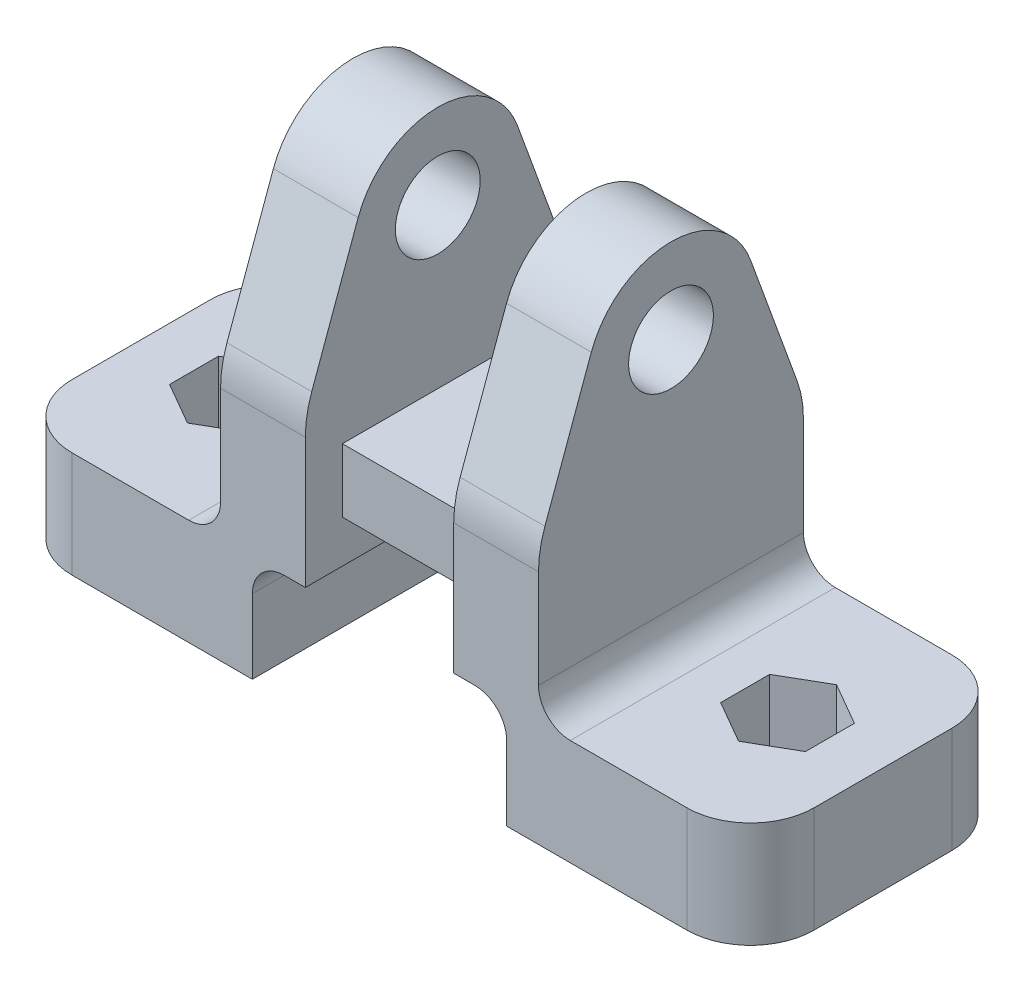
from build123d import *

# Parameters (mm, degrees)
SALIENTE_EXTRUIR1_START       = -7
SALIENTE_EXTRUIR1_DEPTH       = 8
CROQUIS2_W                    = 23
CROQUIS2_H                    = 25
SALIENTE_EXTRUIR2_DEPTH       = 10
CROQUIS3_W                    = 18
CROQUIS3_H                    = 6
SALIENTE_EXTRUIR3_DEPTH       = 7
DI_METRO_DE_TALADRO_8_0_8_1_D = 8
CORTAR_EXTRUIR1_DEPTH         = 55.212544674
REDONDEO1_R                   = 3
REDONDEO2_R                   = 6
REDONDEO3_R                   = 10


with BuildPart() as part:
    # Croquis1 → Saliente-Extruir1 (new body)
    with BuildSketch(Plane(origin=(0, 0, 0), x_dir=(0, 0, -1), z_dir=(1, 0, 0)).offset(SALIENTE_EXTRUIR1_START)):
        with BuildLine():
            Line((0, 10), (-25, 10))
            Line((-25, 10), (-25, 24.046967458))
            Line((-25, 24.046967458), (-20.017540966, 37.736161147))
            ThreePointArc((-20.017540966, 37.736161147), (-12.5, 43), (-4.982459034, 37.736161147))
            Line((-4.982459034, 37.736161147), (0, 24.046967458))
            Line((0, 24.046967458), (0, 10))
        make_face()
    extrude(amount=-SALIENTE_EXTRUIR1_DEPTH)

    # Croquis2 → Saliente-Extruir2 (add)
    with BuildSketch(Plane.XZ.offset(-10)):
        with Locations((-23.5, 12.5)):
            Rectangle(CROQUIS2_W, CROQUIS2_H)
    extrude(amount=SALIENTE_EXTRUIR2_DEPTH)

    # Croquis3 → Saliente-Extruir3 (add)
    with BuildSketch(Plane(origin=(-7, 0, 0), x_dir=(0, 0, -1), z_dir=(1, 0, 0))):
        with Locations((-12.5, 17)):
            Rectangle(CROQUIS3_W, CROQUIS3_H)
    extrude(amount=SALIENTE_EXTRUIR3_DEPTH)

    # Di_metro de taladro _8.0 _8_1 (through all)
    with Locations(Plane.ZY.offset(15)):
        with Locations((12.5, 35)):
            Hole(DI_METRO_DE_TALADRO_8_0_8_1_D / 2)

    # Croquis6 → Cortar-Extruir1 (cut, through all)
    with BuildSketch(Plane(origin=(0, 10, 0), x_dir=(1, 0, 0), z_dir=(0, 1, 0))):
        Polygon((-30, -10.190598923), (-30, -14.809401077), (-26, -17.118802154), (-22, -14.809401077), (-22, -10.190598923), (-26, -7.881197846), align=None)
    extrude(amount=-CORTAR_EXTRUIR1_DEPTH, mode=Mode.SUBTRACT)

    # Redondeo1
    redondeo1_edges = [part.edges().sort_by_distance(p)[0] for p in [
        (-15, 10, 12.5),
        (-12, 10, 12.5),
    ]]
    fillet(redondeo1_edges, radius=REDONDEO1_R)

    # Redondeo2
    redondeo2_edges = [part.edges().sort_by_distance(p)[0] for p in [
        (-35, 5, 25),
        (-35, 5, 0),
    ]]
    fillet(redondeo2_edges, radius=REDONDEO2_R)

    # Redondeo3
    redondeo3_edges = [part.edges().sort_by_distance(p)[0] for p in [
        (-11, 24.046967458, 25),
        (-11, 24.046967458, 0),
    ]]
    fillet(redondeo3_edges, radius=REDONDEO3_R)

    # Simetr_a1: part across plane


with BuildPart() as part_1:
    add(part.part)
    add(part.part.mirror(Plane.ZY))


solid = part_1.part
